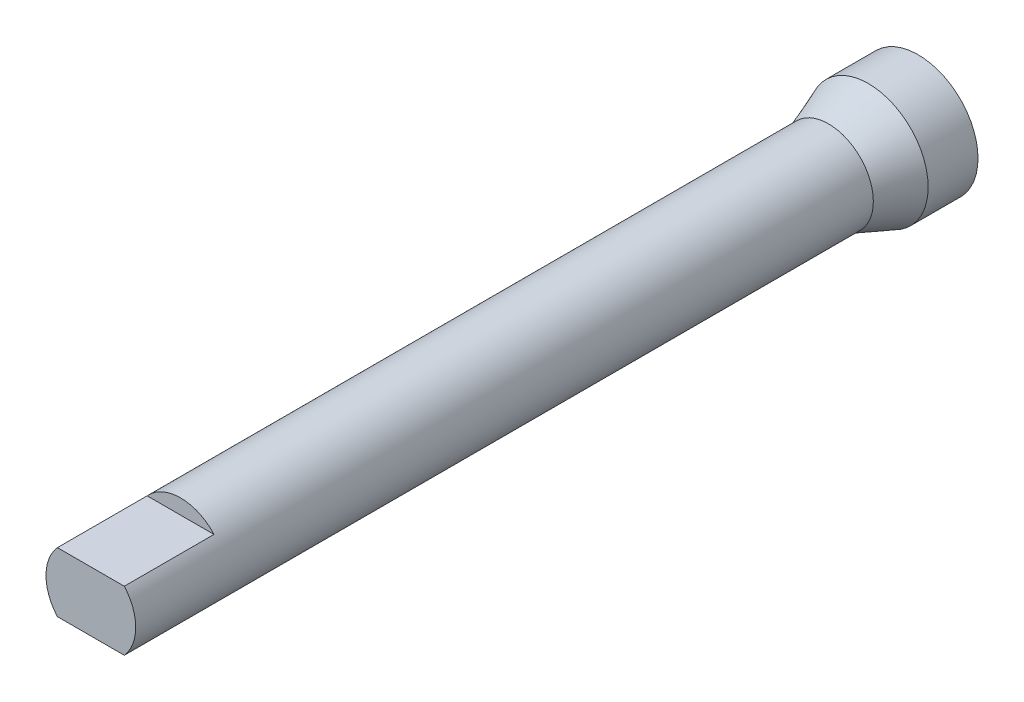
from build123d import *

# Parameters (mm, degrees)
SKETCH3_R           = 22.5
SKETCH3_R_2         = 17.5
BOSS_EXTRUDE1_DEPTH = 320
SKETCH4_R           = 22.5
BOSS_EXTRUDE2_DEPTH = 50
SKETCH5_W           = 33.541019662
SKETCH5_H           = 20
CUT_EXTRUDE1_DEPTH  = 45


with BuildPart() as part:
    # Sketch2 → Revolve1 (revolve)
    with BuildSketch(Plane(origin=(0, 0, 0), x_dir=(1, 0, 0), z_dir=(0, 1, 0)), mode=Mode.PRIVATE) as revolve1_sk:
        Polygon((-30, 0), (-30, -25), (-22.5, -45), (-17.5, -45), (-25, -25), (-25, 0), align=None)
    revolve(revolve1_sk.sketch.rotate(Axis((0, 0, 47.25), (0, 0, -1)), 180), axis=Axis((0, 0, 47.25), (0, 0, -1)))

    # Sketch3 → Boss-Extrude1 (add)
    with BuildSketch(Plane.XY.offset(45)):
        Circle(SKETCH3_R)
        Circle(SKETCH3_R_2, mode=Mode.SUBTRACT)
    extrude(amount=BOSS_EXTRUDE1_DEPTH)

    # Sketch4 → Boss-Extrude2 (add)
    with BuildSketch(Plane.XY.offset(365)):
        Circle(SKETCH4_R)
    extrude(amount=BOSS_EXTRUDE2_DEPTH)

    # Sketch5 → Cut-Extrude1 (cut)
    with BuildSketch(Plane.XY.offset(415)):
        with Locations((0, 25)):
            Rectangle(SKETCH5_W, SKETCH5_H)
        with Locations((0, -25)):
            Rectangle(SKETCH5_W, SKETCH5_H)
    extrude(amount=-CUT_EXTRUDE1_DEPTH, mode=Mode.SUBTRACT)


solid = part.part
